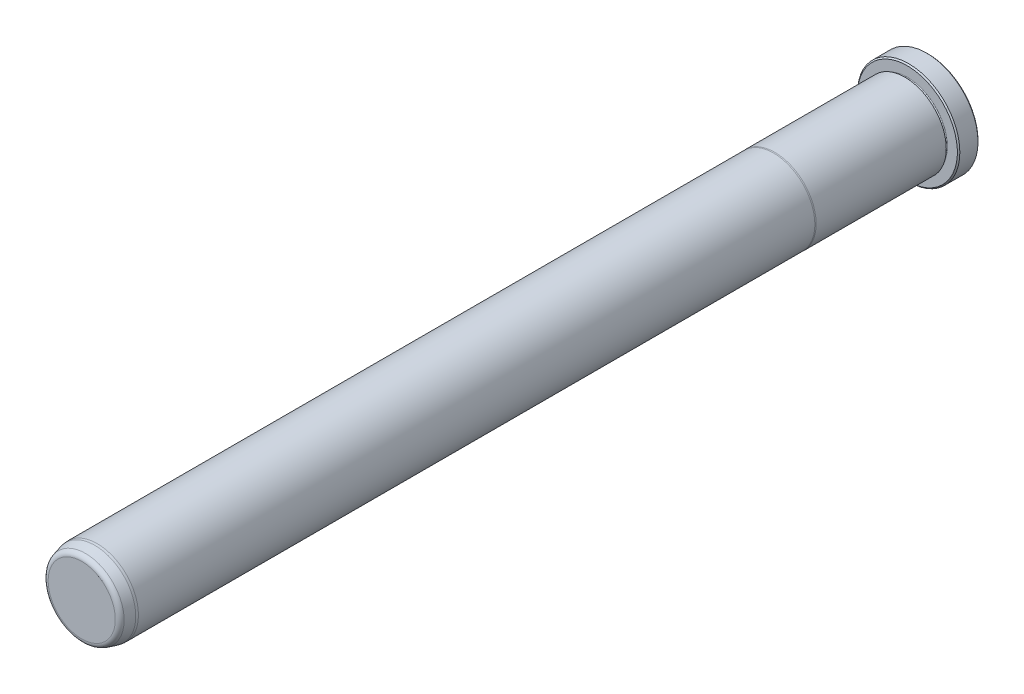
ISO-10303-21;
HEADER;
FILE_DESCRIPTION(('STEP AP214'),'2;1');
FILE_NAME('part.step','',(''),(''),'','','');
FILE_SCHEMA(('AUTOMOTIVE_DESIGN { 1 0 10303 214 1 1 1 1 }'));
ENDSEC;
DATA;
#1=APPLICATION_CONTEXT('core data for automotive mechanical design processes');
#2=APPLICATION_PROTOCOL_DEFINITION('international standard','automotive_design',2000,#1);
#3=PRODUCT_CONTEXT('',#1,'mechanical');
#4=PRODUCT('Part','Part','',(#3));
#5=PRODUCT_RELATED_PRODUCT_CATEGORY('part','',(#4));
#6=PRODUCT_DEFINITION_FORMATION('','',#4);
#7=PRODUCT_DEFINITION_CONTEXT('part definition',#1,'design');
#8=PRODUCT_DEFINITION('design','',#6,#7);
#9=PRODUCT_DEFINITION_SHAPE('','',#8);
#10=(LENGTH_UNIT() NAMED_UNIT(*) SI_UNIT(.MILLI.,.METRE.));
#11=(NAMED_UNIT(*) PLANE_ANGLE_UNIT() SI_UNIT($,.RADIAN.));
#12=(NAMED_UNIT(*) SI_UNIT($,.STERADIAN.) SOLID_ANGLE_UNIT());
#13=UNCERTAINTY_MEASURE_WITH_UNIT(LENGTH_MEASURE(1.E-05),#10,'distance_accuracy_value','');
#14=(GEOMETRIC_REPRESENTATION_CONTEXT(3) GLOBAL_UNCERTAINTY_ASSIGNED_CONTEXT((#13)) GLOBAL_UNIT_ASSIGNED_CONTEXT((#10,
#11,#12)) REPRESENTATION_CONTEXT('',''));
#15=CARTESIAN_POINT('',(0.,0.,0.));
#16=DIRECTION('',(0.,0.,1.));
#17=DIRECTION('',(1.,0.,0.));
#18=AXIS2_PLACEMENT_3D('',#15,#16,#17);
#19=CARTESIAN_POINT('',(0.,0.,0.));
#20=DIRECTION('',(0.,0.,1.));
#21=DIRECTION('',(1.,0.,0.));
#22=AXIS2_PLACEMENT_3D('',#19,#20,#21);
#23=PLANE('',#22);
#24=CARTESIAN_POINT('',(0.,0.,0.));
#25=DIRECTION('',(0.,0.,1.));
#26=DIRECTION('',(1.,0.,0.));
#27=AXIS2_PLACEMENT_3D('',#24,#25,#26);
#28=CIRCLE('',#27,15.367);
#29=CARTESIAN_POINT('',(15.367,0.,0.));
#30=VERTEX_POINT('',#29);
#31=EDGE_CURVE('E37',#30,#30,#28,.F.);
#32=ORIENTED_EDGE('',*,*,#31,.T.);
#33=EDGE_LOOP('',(#32));
#34=FACE_BOUND('',#33,.T.);
#35=ADVANCED_FACE('F30',(#34),#23,.F.);
#36=CARTESIAN_POINT('',(0.,0.,0.));
#37=DIRECTION('',(0.,0.,1.));
#38=DIRECTION('',(1.,0.,0.));
#39=AXIS2_PLACEMENT_3D('',#36,#37,#38);
#40=CYLINDRICAL_SURFACE('',#39,15.748);
#41=CARTESIAN_POINT('',(0.,0.,0.380999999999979));
#42=DIRECTION('',(0.,0.,1.));
#43=DIRECTION('',(1.,0.,0.));
#44=AXIS2_PLACEMENT_3D('',#41,#42,#43);
#45=CIRCLE('',#44,15.748);
#46=CARTESIAN_POINT('',(15.748,0.,0.380999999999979));
#47=VERTEX_POINT('',#46);
#48=EDGE_CURVE('E41',#47,#47,#45,.T.);
#49=ORIENTED_EDGE('',*,*,#48,.T.);
#50=EDGE_LOOP('',(#49));
#51=FACE_BOUND('',#50,.T.);
#52=CARTESIAN_POINT('',(0.,0.,5.9690000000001));
#53=DIRECTION('',(0.,0.,-1.));
#54=DIRECTION('',(-1.,0.,0.));
#55=AXIS2_PLACEMENT_3D('',#52,#53,#54);
#56=CIRCLE('',#55,15.748);
#57=CARTESIAN_POINT('',(-15.748,0.,5.9690000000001));
#58=VERTEX_POINT('',#57);
#59=EDGE_CURVE('E45',#58,#58,#56,.T.);
#60=ORIENTED_EDGE('',*,*,#59,.T.);
#61=EDGE_LOOP('',(#60));
#62=FACE_BOUND('',#61,.T.);
#63=ADVANCED_FACE('F118',(#51,#62),#40,.T.);
#64=CARTESIAN_POINT('',(0.,15.748,6.35));
#65=DIRECTION('',(0.,0.,-1.));
#66=DIRECTION('',(-1.,0.,0.));
#67=AXIS2_PLACEMENT_3D('',#64,#65,#66);
#68=PLANE('',#67);
#69=CARTESIAN_POINT('',(0.,0.,6.35));
#70=DIRECTION('',(0.,0.,-1.));
#71=DIRECTION('',(-1.,0.,0.));
#72=AXIS2_PLACEMENT_3D('',#69,#70,#71);
#73=CIRCLE('',#72,15.3670000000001);
#74=CARTESIAN_POINT('',(-15.3670000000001,0.,6.35));
#75=VERTEX_POINT('',#74);
#76=EDGE_CURVE('E10',#75,#75,#73,.F.);
#77=ORIENTED_EDGE('',*,*,#76,.T.);
#78=EDGE_LOOP('',(#77));
#79=FACE_BOUND('',#78,.T.);
#80=CARTESIAN_POINT('',(0.,0.,6.35));
#81=DIRECTION('',(0.,0.,1.));
#82=DIRECTION('',(1.,0.,0.));
#83=AXIS2_PLACEMENT_3D('',#80,#81,#82);
#84=CIRCLE('',#83,12.3063);
#85=CARTESIAN_POINT('',(12.3063,0.,6.35));
#86=VERTEX_POINT('',#85);
#87=EDGE_CURVE('E56',#86,#86,#84,.T.);
#88=ORIENTED_EDGE('',*,*,#87,.F.);
#89=EDGE_LOOP('',(#88));
#90=FACE_BOUND('',#89,.T.);
#91=ADVANCED_FACE('F113',(#79,#90),#68,.F.);
#92=CARTESIAN_POINT('',(0.,0.,6.731));
#93=DIRECTION('',(0.,0.,1.));
#94=DIRECTION('',(1.,0.,0.));
#95=AXIS2_PLACEMENT_3D('',#92,#93,#94);
#96=TOROIDAL_SURFACE('',#95,12.3063,0.381);
#97=CARTESIAN_POINT('',(0.,0.,7.112));
#98=DIRECTION('',(0.,0.,1.));
#99=DIRECTION('',(1.,0.,0.));
#100=AXIS2_PLACEMENT_3D('',#97,#98,#99);
#101=CIRCLE('',#100,12.3063);
#102=CARTESIAN_POINT('',(12.3063,0.,7.112));
#103=VERTEX_POINT('',#102);
#104=EDGE_CURVE('E59',#103,#103,#101,.T.);
#105=ORIENTED_EDGE('',*,*,#104,.F.);
#106=EDGE_LOOP('',(#105));
#107=FACE_BOUND('',#106,.T.);
#108=ORIENTED_EDGE('',*,*,#87,.T.);
#109=EDGE_LOOP('',(#108));
#110=FACE_BOUND('',#109,.T.);
#111=ADVANCED_FACE('F107',(#107,#110),#96,.F.);
#112=CARTESIAN_POINT('',(0.,12.3063,7.112));
#113=DIRECTION('',(0.,0.,1.));
#114=DIRECTION('',(1.,0.,0.));
#115=AXIS2_PLACEMENT_3D('',#112,#113,#114);
#116=PLANE('',#115);
#117=CARTESIAN_POINT('',(0.,0.,7.112));
#118=DIRECTION('',(0.,0.,1.));
#119=DIRECTION('',(1.,0.,0.));
#120=AXIS2_PLACEMENT_3D('',#117,#118,#119);
#121=CIRCLE('',#120,12.7127);
#122=CARTESIAN_POINT('',(12.7127,0.,7.112));
#123=VERTEX_POINT('',#122);
#124=EDGE_CURVE('E62',#123,#123,#121,.T.);
#125=ORIENTED_EDGE('',*,*,#124,.F.);
#126=EDGE_LOOP('',(#125));
#127=FACE_BOUND('',#126,.T.);
#128=ORIENTED_EDGE('',*,*,#104,.T.);
#129=EDGE_LOOP('',(#128));
#130=FACE_BOUND('',#129,.T.);
#131=ADVANCED_FACE('F101',(#127,#130),#116,.F.);
#132=CARTESIAN_POINT('',(0.,0.,0.));
#133=DIRECTION('',(0.,0.,1.));
#134=DIRECTION('',(1.,0.,0.));
#135=AXIS2_PLACEMENT_3D('',#132,#133,#134);
#136=CYLINDRICAL_SURFACE('',#135,12.7127);
#137=CARTESIAN_POINT('',(0.,0.,47.1347630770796));
#138=DIRECTION('',(0.,0.,1.));
#139=DIRECTION('',(1.,0.,0.));
#140=AXIS2_PLACEMENT_3D('',#137,#138,#139);
#141=CIRCLE('',#140,12.7127);
#142=CARTESIAN_POINT('',(12.7127,0.,47.1347630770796));
#143=VERTEX_POINT('',#142);
#144=EDGE_CURVE('E65',#143,#143,#141,.T.);
#145=ORIENTED_EDGE('',*,*,#144,.F.);
#146=EDGE_LOOP('',(#145));
#147=FACE_BOUND('',#146,.T.);
#148=ORIENTED_EDGE('',*,*,#124,.T.);
#149=EDGE_LOOP('',(#148));
#150=FACE_BOUND('',#149,.T.);
#151=ADVANCED_FACE('F95',(#147,#150),#136,.T.);
#152=CARTESIAN_POINT('',(0.,0.,47.1347630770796));
#153=DIRECTION('',(0.,0.,-1.));
#154=DIRECTION('',(-1.,0.,0.));
#155=AXIS2_PLACEMENT_3D('',#152,#153,#154);
#156=CONICAL_SURFACE('',#155,12.7127,0.0698131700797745);
#157=CARTESIAN_POINT('',(0.,0.,47.498));
#158=DIRECTION('',(0.,0.,1.));
#159=DIRECTION('',(1.,0.,0.));
#160=AXIS2_PLACEMENT_3D('',#157,#158,#159);
#161=CIRCLE('',#160,12.6873);
#162=CARTESIAN_POINT('',(12.6873,0.,47.498));
#163=VERTEX_POINT('',#162);
#164=EDGE_CURVE('E68',#163,#163,#161,.T.);
#165=ORIENTED_EDGE('',*,*,#164,.F.);
#166=EDGE_LOOP('',(#165));
#167=FACE_BOUND('',#166,.T.);
#168=ORIENTED_EDGE('',*,*,#144,.T.);
#169=EDGE_LOOP('',(#168));
#170=FACE_BOUND('',#169,.T.);
#171=ADVANCED_FACE('F89',(#167,#170),#156,.T.);
#172=CARTESIAN_POINT('',(0.,0.,0.));
#173=DIRECTION('',(0.,0.,1.));
#174=DIRECTION('',(1.,0.,0.));
#175=AXIS2_PLACEMENT_3D('',#172,#173,#174);
#176=CYLINDRICAL_SURFACE('',#175,12.6873);
#177=CARTESIAN_POINT('',(0.,0.,255.5875));
#178=DIRECTION('',(0.,0.,1.));
#179=DIRECTION('',(1.,0.,0.));
#180=AXIS2_PLACEMENT_3D('',#177,#178,#179);
#181=CIRCLE('',#180,12.6873);
#182=CARTESIAN_POINT('',(12.6873,0.,255.5875));
#183=VERTEX_POINT('',#182);
#184=EDGE_CURVE('E71',#183,#183,#181,.T.);
#185=ORIENTED_EDGE('',*,*,#184,.F.);
#186=EDGE_LOOP('',(#185));
#187=FACE_BOUND('',#186,.T.);
#188=ORIENTED_EDGE('',*,*,#164,.T.);
#189=EDGE_LOOP('',(#188));
#190=FACE_BOUND('',#189,.T.);
#191=ADVANCED_FACE('F83',(#187,#190),#176,.T.);
#192=CARTESIAN_POINT('',(0.,0.,255.5875));
#193=DIRECTION('',(0.,0.,-1.));
#194=DIRECTION('',(-1.,0.,0.));
#195=AXIS2_PLACEMENT_3D('',#192,#193,#194);
#196=CONICAL_SURFACE('',#195,12.6873,0.0872664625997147);
#197=CARTESIAN_POINT('',(0.,0.,256.3495));
#198=DIRECTION('',(0.,0.,1.));
#199=DIRECTION('',(1.,0.,0.));
#200=AXIS2_PLACEMENT_3D('',#197,#198,#199);
#201=CIRCLE('',#200,12.6206336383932);
#202=CARTESIAN_POINT('',(12.6206336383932,0.,256.3495));
#203=VERTEX_POINT('',#202);
#204=EDGE_CURVE('E74',#203,#203,#201,.T.);
#205=ORIENTED_EDGE('',*,*,#204,.F.);
#206=EDGE_LOOP('',(#205));
#207=FACE_BOUND('',#206,.T.);
#208=ORIENTED_EDGE('',*,*,#184,.T.);
#209=EDGE_LOOP('',(#208));
#210=FACE_BOUND('',#209,.T.);
#211=ADVANCED_FACE('F80',(#207,#210),#196,.T.);
#212=CARTESIAN_POINT('',(0.,0.,256.3495));
#213=DIRECTION('',(0.,0.,-1.));
#214=DIRECTION('',(-1.,0.,0.));
#215=AXIS2_PLACEMENT_3D('',#212,#213,#214);
#216=CONICAL_SURFACE('',#215,12.6206336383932,0.26179938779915);
#217=CARTESIAN_POINT('',(0.,0.,259.1733752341));
#218=DIRECTION('',(0.,0.,1.));
#219=DIRECTION('',(1.,0.,0.));
#220=AXIS2_PLACEMENT_3D('',#217,#218,#219);
#221=CIRCLE('',#220,11.8639785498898);
#222=CARTESIAN_POINT('',(11.8639785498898,0.,259.1733752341));
#223=VERTEX_POINT('',#222);
#224=EDGE_CURVE('E50',#223,#223,#221,.F.);
#225=ORIENTED_EDGE('',*,*,#224,.T.);
#226=EDGE_LOOP('',(#225));
#227=FACE_BOUND('',#226,.T.);
#228=ORIENTED_EDGE('',*,*,#204,.T.);
#229=EDGE_LOOP('',(#228));
#230=FACE_BOUND('',#229,.T.);
#231=ADVANCED_FACE('F78',(#227,#230),#216,.T.);
#232=CARTESIAN_POINT('',(0.,11.5487028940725,260.35));
#233=DIRECTION('',(0.,0.,-1.));
#234=DIRECTION('',(-1.,0.,0.));
#235=AXIS2_PLACEMENT_3D('',#232,#233,#234);
#236=PLANE('',#235);
#237=CARTESIAN_POINT('',(0.,0.,260.35));
#238=DIRECTION('',(0.,0.,-1.));
#239=DIRECTION('',(-1.,0.,0.));
#240=AXIS2_PLACEMENT_3D('',#237,#238,#239);
#241=CIRCLE('',#240,10.3305713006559);
#242=CARTESIAN_POINT('',(-10.3305713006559,0.,260.35));
#243=VERTEX_POINT('',#242);
#244=EDGE_CURVE('E53',#243,#243,#241,.F.);
#245=ORIENTED_EDGE('',*,*,#244,.T.);
#246=EDGE_LOOP('',(#245));
#247=FACE_BOUND('',#246,.T.);
#248=ADVANCED_FACE('F133',(#247),#236,.F.);
#249=CARTESIAN_POINT('',(0.,0.,258.7625));
#250=DIRECTION('',(0.,0.,-1.));
#251=DIRECTION('',(-1.,0.,0.));
#252=AXIS2_PLACEMENT_3D('',#249,#250,#251);
#253=TOROIDAL_SURFACE('',#252,10.3305713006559,1.5875);
#254=ORIENTED_EDGE('',*,*,#224,.F.);
#255=EDGE_LOOP('',(#254));
#256=FACE_BOUND('',#255,.T.);
#257=ORIENTED_EDGE('',*,*,#244,.F.);
#258=EDGE_LOOP('',(#257));
#259=FACE_BOUND('',#258,.T.);
#260=ADVANCED_FACE('F130',(#256,#259),#253,.T.);
#261=CARTESIAN_POINT('',(0.,0.,0.380999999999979));
#262=DIRECTION('',(0.,0.,1.));
#263=DIRECTION('',(1.,0.,0.));
#264=AXIS2_PLACEMENT_3D('',#261,#262,#263);
#265=CONICAL_SURFACE('',#264,15.748,0.785398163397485);
#266=ORIENTED_EDGE('',*,*,#31,.F.);
#267=EDGE_LOOP('',(#266));
#268=FACE_BOUND('',#267,.T.);
#269=ORIENTED_EDGE('',*,*,#48,.F.);
#270=EDGE_LOOP('',(#269));
#271=FACE_BOUND('',#270,.T.);
#272=ADVANCED_FACE('F132',(#268,#271),#265,.T.);
#273=CARTESIAN_POINT('',(0.,0.,6.35));
#274=DIRECTION('',(0.,0.,-1.));
#275=DIRECTION('',(-1.,0.,0.));
#276=AXIS2_PLACEMENT_3D('',#273,#274,#275);
#277=CONICAL_SURFACE('',#276,15.3670000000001,0.785398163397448);
#278=ORIENTED_EDGE('',*,*,#59,.F.);
#279=EDGE_LOOP('',(#278));
#280=FACE_BOUND('',#279,.T.);
#281=ORIENTED_EDGE('',*,*,#76,.F.);
#282=EDGE_LOOP('',(#281));
#283=FACE_BOUND('',#282,.T.);
#284=ADVANCED_FACE('F32',(#280,#283),#277,.T.);
#285=CLOSED_SHELL('',(#35,#63,#91,#111,#131,#151,#171,#191,#211,#231,#248,#260,#272,#284));
#286=MANIFOLD_SOLID_BREP('B2',#285);
#287=ADVANCED_BREP_SHAPE_REPRESENTATION('',(#18,#286),#14);
#288=SHAPE_DEFINITION_REPRESENTATION(#9,#287);
ENDSEC;
END-ISO-10303-21;
